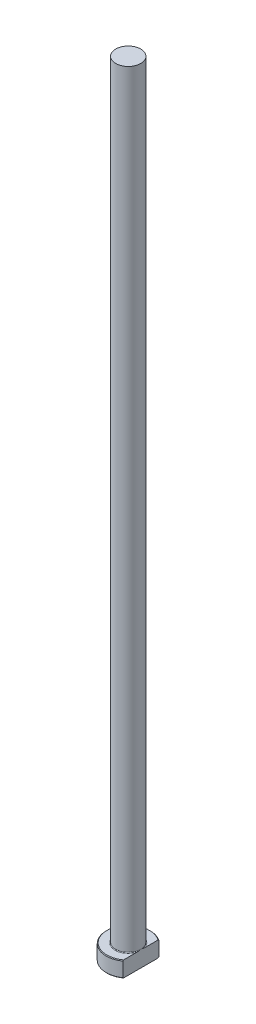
ISO-10303-21;
HEADER;
FILE_DESCRIPTION(('STEP AP214'),'2;1');
FILE_NAME('part.step','',(''),(''),'','','');
FILE_SCHEMA(('AUTOMOTIVE_DESIGN { 1 0 10303 214 1 1 1 1 }'));
ENDSEC;
DATA;
#1=APPLICATION_CONTEXT('core data for automotive mechanical design processes');
#2=APPLICATION_PROTOCOL_DEFINITION('international standard','automotive_design',2000,#1);
#3=PRODUCT_CONTEXT('',#1,'mechanical');
#4=PRODUCT('Part','Part','',(#3));
#5=PRODUCT_RELATED_PRODUCT_CATEGORY('part','',(#4));
#6=PRODUCT_DEFINITION_FORMATION('','',#4);
#7=PRODUCT_DEFINITION_CONTEXT('part definition',#1,'design');
#8=PRODUCT_DEFINITION('design','',#6,#7);
#9=PRODUCT_DEFINITION_SHAPE('','',#8);
#10=(LENGTH_UNIT() NAMED_UNIT(*) SI_UNIT(.MILLI.,.METRE.));
#11=(NAMED_UNIT(*) PLANE_ANGLE_UNIT() SI_UNIT($,.RADIAN.));
#12=(NAMED_UNIT(*) SI_UNIT($,.STERADIAN.) SOLID_ANGLE_UNIT());
#13=UNCERTAINTY_MEASURE_WITH_UNIT(LENGTH_MEASURE(1.E-05),#10,'distance_accuracy_value','');
#14=(GEOMETRIC_REPRESENTATION_CONTEXT(3) GLOBAL_UNCERTAINTY_ASSIGNED_CONTEXT((#13)) GLOBAL_UNIT_ASSIGNED_CONTEXT((#10,
#11,#12)) REPRESENTATION_CONTEXT('',''));
#15=CARTESIAN_POINT('',(0.,0.,0.));
#16=DIRECTION('',(0.,0.,1.));
#17=DIRECTION('',(1.,0.,0.));
#18=AXIS2_PLACEMENT_3D('',#15,#16,#17);
#19=CARTESIAN_POINT('',(0.,0.,0.));
#20=DIRECTION('',(0.,-1.,0.));
#21=DIRECTION('',(0.,0.,-1.));
#22=AXIS2_PLACEMENT_3D('',#19,#20,#21);
#23=PLANE('',#22);
#24=CARTESIAN_POINT('',(0.,0.,0.));
#25=DIRECTION('',(0.,-1.,0.));
#26=DIRECTION('',(0.,0.,-1.));
#27=AXIS2_PLACEMENT_3D('',#24,#25,#26);
#28=CIRCLE('',#27,6.79999999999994);
#29=CARTESIAN_POINT('',(3.99999999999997,0.,5.49909083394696));
#30=VERTEX_POINT('',#29);
#31=CARTESIAN_POINT('',(3.99999999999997,0.,-5.49909083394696));
#32=VERTEX_POINT('',#31);
#33=EDGE_CURVE('E98',#30,#32,#28,.T.);
#34=ORIENTED_EDGE('',*,*,#33,.T.);
#35=DIRECTION('',(0.,0.,1.));
#36=VECTOR('',#35,1.);
#37=CARTESIAN_POINT('',(3.99999999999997,0.,-5.74456264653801));
#38=LINE('',#37,#36);
#39=EDGE_CURVE('E83',#32,#30,#38,.T.);
#40=ORIENTED_EDGE('',*,*,#39,.T.);
#41=EDGE_LOOP('',(#34,#40));
#42=FACE_BOUND('',#41,.T.);
#43=ADVANCED_FACE('F32',(#42),#23,.T.);
#44=CARTESIAN_POINT('',(0.,259.958771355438,0.));
#45=DIRECTION('',(0.,1.,0.));
#46=DIRECTION('',(0.,0.,1.));
#47=AXIS2_PLACEMENT_3D('',#44,#45,#46);
#48=CYLINDRICAL_SURFACE('',#47,6.99999999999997);
#49=CARTESIAN_POINT('',(0.,4.80000000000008,0.));
#50=DIRECTION('',(0.,1.,0.));
#51=DIRECTION('',(0.,0.,1.));
#52=AXIS2_PLACEMENT_3D('',#49,#50,#51);
#53=CIRCLE('',#52,6.99999999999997);
#54=CARTESIAN_POINT('',(3.99999999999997,4.80000000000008,5.74456264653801));
#55=VERTEX_POINT('',#54);
#56=CARTESIAN_POINT('',(3.99999999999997,4.80000000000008,-5.74456264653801));
#57=VERTEX_POINT('',#56);
#58=EDGE_CURVE('E104',#55,#57,#53,.F.);
#59=ORIENTED_EDGE('',*,*,#58,.T.);
#60=DIRECTION('',(0.,-1.,0.));
#61=VECTOR('',#60,1.);
#62=CARTESIAN_POINT('',(3.99999999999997,250.,-5.74456264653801));
#63=LINE('',#62,#61);
#64=CARTESIAN_POINT('',(3.99999999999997,0.200000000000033,-5.74456264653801));
#65=VERTEX_POINT('',#64);
#66=EDGE_CURVE('E183',#57,#65,#63,.T.);
#67=ORIENTED_EDGE('',*,*,#66,.T.);
#68=CARTESIAN_POINT('',(0.,0.200000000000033,0.));
#69=DIRECTION('',(0.,-1.,0.));
#70=DIRECTION('',(0.,0.,-1.));
#71=AXIS2_PLACEMENT_3D('',#68,#69,#70);
#72=CIRCLE('',#71,6.99999999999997);
#73=CARTESIAN_POINT('',(3.99999999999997,0.200000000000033,5.74456264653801));
#74=VERTEX_POINT('',#73);
#75=EDGE_CURVE('E100',#65,#74,#72,.F.);
#76=ORIENTED_EDGE('',*,*,#75,.T.);
#77=DIRECTION('',(0.,-1.,0.));
#78=VECTOR('',#77,1.);
#79=CARTESIAN_POINT('',(3.99999999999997,250.,5.74456264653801));
#80=LINE('',#79,#78);
#81=EDGE_CURVE('E93',#55,#74,#80,.T.);
#82=ORIENTED_EDGE('',*,*,#81,.F.);
#83=EDGE_LOOP('',(#59,#67,#76,#82));
#84=FACE_BOUND('',#83,.T.);
#85=ADVANCED_FACE('F158',(#84),#48,.T.);
#86=CARTESIAN_POINT('',(-6.99999999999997,5.,0.));
#87=DIRECTION('',(0.,1.,0.));
#88=DIRECTION('',(0.,0.,1.));
#89=AXIS2_PLACEMENT_3D('',#86,#87,#88);
#90=PLANE('',#89);
#91=CARTESIAN_POINT('',(0.,5.,0.));
#92=DIRECTION('',(0.,1.,0.));
#93=DIRECTION('',(0.,0.,1.));
#94=AXIS2_PLACEMENT_3D('',#91,#92,#93);
#95=CIRCLE('',#94,6.80000000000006);
#96=CARTESIAN_POINT('',(3.99999999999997,5.,-5.4990908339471));
#97=VERTEX_POINT('',#96);
#98=CARTESIAN_POINT('',(3.99999999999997,5.,5.4990908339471));
#99=VERTEX_POINT('',#98);
#100=EDGE_CURVE('E178',#97,#99,#95,.T.);
#101=ORIENTED_EDGE('',*,*,#100,.T.);
#102=DIRECTION('',(0.,0.,-1.));
#103=VECTOR('',#102,1.);
#104=CARTESIAN_POINT('',(3.99999999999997,5.,0.));
#105=LINE('',#104,#103);
#106=CARTESIAN_POINT('',(3.99999999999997,4.99999999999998,1.28062484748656));
#107=VERTEX_POINT('',#106);
#108=EDGE_CURVE('E57',#99,#107,#105,.T.);
#109=ORIENTED_EDGE('',*,*,#108,.T.);
#110=CARTESIAN_POINT('',(0.,5.,0.));
#111=DIRECTION('',(0.,1.,0.));
#112=DIRECTION('',(0.,0.,1.));
#113=AXIS2_PLACEMENT_3D('',#110,#111,#112);
#114=CIRCLE('',#113,4.19999999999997);
#115=CARTESIAN_POINT('',(3.99999999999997,4.99999999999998,-1.28062484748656));
#116=VERTEX_POINT('',#115);
#117=EDGE_CURVE('E107',#107,#116,#114,.F.);
#118=ORIENTED_EDGE('',*,*,#117,.T.);
#119=EDGE_CURVE('E136',#116,#97,#105,.T.);
#120=ORIENTED_EDGE('',*,*,#119,.T.);
#121=EDGE_LOOP('',(#101,#109,#118,#120));
#122=FACE_BOUND('',#121,.T.);
#123=ADVANCED_FACE('F147',(#122),#90,.T.);
#124=CARTESIAN_POINT('',(0.,5.,0.));
#125=DIRECTION('',(0.,-1.,0.));
#126=DIRECTION('',(0.,0.,-1.));
#127=AXIS2_PLACEMENT_3D('',#124,#125,#126);
#128=CONICAL_SURFACE('',#127,6.80000000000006,0.785398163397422);
#129=ORIENTED_EDGE('',*,*,#58,.F.);
#130=CARTESIAN_POINT('',(3.99999999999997,-1.45712845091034,12.6392822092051));
#131=CARTESIAN_POINT('',(3.99999999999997,-1.24364466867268,12.4153556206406));
#132=CARTESIAN_POINT('',(3.99999999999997,-1.03042430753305,12.1911774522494));
#133=CARTESIAN_POINT('',(3.99999999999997,-0.604617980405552,11.7422167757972));
#134=CARTESIAN_POINT('',(3.99999999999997,-0.392032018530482,11.5174342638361));
#135=CARTESIAN_POINT('',(3.99999999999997,0.032462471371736,11.0670952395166));
#136=CARTESIAN_POINT('',(3.99999999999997,0.244370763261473,10.8415385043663));
#137=CARTESIAN_POINT('',(3.99999999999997,0.667290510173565,10.3895875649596));
#138=CARTESIAN_POINT('',(3.99999999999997,0.878301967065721,10.1631933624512));
#139=CARTESIAN_POINT('',(3.99999999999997,1.51385375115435,9.4781012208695));
#140=CARTESIAN_POINT('',(3.99999999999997,1.93676291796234,9.01788214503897));
#141=CARTESIAN_POINT('',(3.99999999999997,2.56612335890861,8.32309905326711));
#142=CARTESIAN_POINT('',(3.99999999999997,2.77505666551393,8.09078457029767));
#143=CARTESIAN_POINT('',(3.99999999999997,3.19080254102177,7.62426940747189));
#144=CARTESIAN_POINT('',(3.99999999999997,3.3976151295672,7.39006874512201));
#145=CARTESIAN_POINT('',(3.99999999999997,3.87870763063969,6.83891844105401));
#146=CARTESIAN_POINT('',(3.99999999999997,4.15190978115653,6.52102188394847));
#147=CARTESIAN_POINT('',(3.99999999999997,4.55642425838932,6.03960901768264));
#148=CARTESIAN_POINT('',(3.99999999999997,4.6904105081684,5.87833992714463));
#149=CARTESIAN_POINT('',(3.99999999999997,4.95616531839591,5.55398469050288));
#150=CARTESIAN_POINT('',(3.99999999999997,5.08793391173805,5.39089857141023));
#151=CARTESIAN_POINT('',(3.99999999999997,5.3484171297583,5.06288801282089));
#152=CARTESIAN_POINT('',(3.99999999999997,5.47713786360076,4.89796843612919));
#153=CARTESIAN_POINT('',(3.99999999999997,5.73107494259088,4.56545535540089));
#154=CARTESIAN_POINT('',(3.99999999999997,5.85629144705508,4.39786197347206));
#155=CARTESIAN_POINT('',(3.99999999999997,6.10211465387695,4.05948444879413));
#156=CARTESIAN_POINT('',(3.99999999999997,6.22272435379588,3.88870249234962));
#157=CARTESIAN_POINT('',(3.99999999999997,6.45796076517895,3.54308312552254));
#158=CARTESIAN_POINT('',(3.99999999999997,6.57258867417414,3.36824653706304));
#159=CARTESIAN_POINT('',(3.99999999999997,6.76866603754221,3.05381396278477));
#160=CARTESIAN_POINT('',(3.99999999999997,6.85173773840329,2.91523359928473));
#161=CARTESIAN_POINT('',(3.99999999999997,7.01174537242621,2.63451965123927));
#162=CARTESIAN_POINT('',(3.99999999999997,7.0886804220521,2.49238555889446));
#163=CARTESIAN_POINT('',(3.99999999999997,7.23459437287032,2.20416961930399));
#164=CARTESIAN_POINT('',(3.99999999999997,7.30357836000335,2.05809037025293));
#165=CARTESIAN_POINT('',(3.99999999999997,7.43135520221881,1.76151732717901));
#166=CARTESIAN_POINT('',(3.99999999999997,7.49015114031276,1.61102488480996));
#167=CARTESIAN_POINT('',(3.99999999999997,7.5824931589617,1.341420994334));
#168=CARTESIAN_POINT('',(3.99999999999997,7.61872660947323,1.22323501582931));
#169=CARTESIAN_POINT('',(3.99999999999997,7.68223354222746,0.984492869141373));
#170=CARTESIAN_POINT('',(3.99999999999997,7.7095104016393,0.863937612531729));
#171=CARTESIAN_POINT('',(3.99999999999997,7.75377914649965,0.62134258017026));
#172=CARTESIAN_POINT('',(3.99999999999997,7.77080509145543,0.499309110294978));
#173=CARTESIAN_POINT('',(3.99999999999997,7.79378778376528,0.254194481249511));
#174=CARTESIAN_POINT('',(3.99999999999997,7.79974523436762,0.13111338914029));
#175=CARTESIAN_POINT('',(3.99999999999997,7.8002395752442,-0.115517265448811));
#176=CARTESIAN_POINT('',(3.99999999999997,7.79473514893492,-0.239066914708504));
#177=CARTESIAN_POINT('',(3.99999999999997,7.77255119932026,-0.48514894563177));
#178=CARTESIAN_POINT('',(3.99999999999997,7.75587091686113,-0.607681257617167));
#179=CARTESIAN_POINT('',(3.99999999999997,7.71218353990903,-0.851269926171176));
#180=CARTESIAN_POINT('',(3.99999999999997,7.6851436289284,-0.972320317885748));
#181=CARTESIAN_POINT('',(3.99999999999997,7.62201202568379,-1.21200276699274));
#182=CARTESIAN_POINT('',(3.99999999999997,7.58591962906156,-1.33063463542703));
#183=CARTESIAN_POINT('',(3.99999999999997,7.45980070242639,-1.70122439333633));
#184=CARTESIAN_POINT('',(3.99999999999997,7.35572950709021,-1.94843335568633));
#185=CARTESIAN_POINT('',(3.99999999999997,7.18186715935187,-2.31048534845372));
#186=CARTESIAN_POINT('',(3.99999999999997,7.1208768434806,-2.429835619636));
#187=CARTESIAN_POINT('',(3.99999999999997,6.9940353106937,-2.66593629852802));
#188=CARTESIAN_POINT('',(3.99999999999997,6.92818466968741,-2.7826870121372));
#189=CARTESIAN_POINT('',(3.99999999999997,6.79157875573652,-3.01550895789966));
#190=CARTESIAN_POINT('',(3.99999999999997,6.72076681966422,-3.13154660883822));
#191=CARTESIAN_POINT('',(3.99999999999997,6.57583116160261,-3.36153379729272));
#192=CARTESIAN_POINT('',(3.99999999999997,6.50170736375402,-3.47548328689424));
#193=CARTESIAN_POINT('',(3.99999999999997,6.35080982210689,-3.70145107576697));
#194=CARTESIAN_POINT('',(3.99999999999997,6.27403866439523,-3.8134711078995));
#195=CARTESIAN_POINT('',(3.99999999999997,6.11824120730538,-4.03592316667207));
#196=CARTESIAN_POINT('',(3.99999999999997,6.03921496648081,-4.1463552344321));
#197=CARTESIAN_POINT('',(3.99999999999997,5.81506547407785,-4.45397159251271));
#198=CARTESIAN_POINT('',(3.99999999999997,5.66782256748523,-4.64961120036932));
#199=CARTESIAN_POINT('',(3.99999999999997,5.36880597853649,-5.03740600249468));
#200=CARTESIAN_POINT('',(3.99999999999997,5.21703183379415,-5.2295608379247));
#201=CARTESIAN_POINT('',(3.99999999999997,4.90999105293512,-5.61115465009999));
#202=CARTESIAN_POINT('',(3.99999999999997,4.75472331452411,-5.80059273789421));
#203=CARTESIAN_POINT('',(3.99999999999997,4.44150758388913,-6.17724364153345));
#204=CARTESIAN_POINT('',(3.99999999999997,4.28355951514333,-6.36445639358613));
#205=CARTESIAN_POINT('',(3.99999999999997,3.96525805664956,-6.73740614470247));
#206=CARTESIAN_POINT('',(3.99999999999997,3.80490084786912,-6.92313987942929));
#207=CARTESIAN_POINT('',(3.99999999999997,3.48247055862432,-7.29311320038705));
#208=CARTESIAN_POINT('',(3.99999999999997,3.32039746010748,-7.47735277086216));
#209=CARTESIAN_POINT('',(3.99999999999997,2.83216188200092,-8.02814826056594));
#210=CARTESIAN_POINT('',(3.99999999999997,2.50391696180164,-8.39285790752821));
#211=CARTESIAN_POINT('',(3.99999999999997,1.87512078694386,-9.08414492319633));
#212=CARTESIAN_POINT('',(3.99999999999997,1.57491666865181,-9.41103929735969));
#213=CARTESIAN_POINT('',(3.99999999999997,0.972153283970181,-10.0626830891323));
#214=CARTESIAN_POINT('',(3.99999999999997,0.669593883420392,-10.387432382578));
#215=CARTESIAN_POINT('',(3.99999999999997,0.0637759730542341,-11.0341169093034));
#216=CARTESIAN_POINT('',(3.99999999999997,-0.239476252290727,-11.3560580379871));
#217=CARTESIAN_POINT('',(3.99999999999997,-0.847356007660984,-11.9985921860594));
#218=CARTESIAN_POINT('',(3.99999999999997,-1.15198342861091,-12.3191853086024));
#219=CARTESIAN_POINT('',(3.99999999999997,-1.45712845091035,-12.6392822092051));
#220=B_SPLINE_CURVE_WITH_KNOTS('',3,(#130,#131,#132,#133,#134,#135,#136,#137,#138,#139,#140,
#141,#142,#143,#144,#145,#146,#147,#148,#149,#150,#151,#152,#153,#154,#155,#156,#157,#158,#159,
#160,#161,#162,#163,#164,#165,#166,#167,#168,#169,#170,#171,#172,#173,#174,#175,#176,#177,#178,
#179,#180,#181,#182,#183,#184,#185,#186,#187,#188,#189,#190,#191,#192,#193,#194,#195,#196,#197,
#198,#199,#200,#201,#202,#203,#204,#205,#206,#207,#208,#209,#210,#211,#212,#213,#214,#215,#216,
#217,#218,#219),.UNSPECIFIED.,.F.,.F.,(4,2,2,2,2,2,2,2,2,2,2,2,2,2,2,2,2,2,2,2,2,2,2,2,2,2,2,2,
2,2,2,2,2,2,2,2,2,2,2,2,2,2,2,2,4),(0.,0.928152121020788,1.85631024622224,2.7847626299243,
3.71321307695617,5.58823033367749,6.52556078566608,7.46288254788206,8.7202857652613,
9.34927045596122,9.97824580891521,10.6058302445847,11.2333861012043,11.8605264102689,
12.4875406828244,12.972136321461,13.4568016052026,13.9411551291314,14.4253618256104,
14.7959147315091,15.1663277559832,15.5355031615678,15.904655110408,16.2751400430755,
16.6456501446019,17.0173437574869,17.3890663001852,18.1913996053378,18.5934522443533,
18.9954573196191,19.4032100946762,19.8109722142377,20.2183467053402,20.6257106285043,
21.3601838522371,22.0947322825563,22.8295158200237,23.5643203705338,24.3004480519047,
25.036583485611,26.508549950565,27.8400191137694,29.1715646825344,30.4983881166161,
31.8251080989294),.UNSPECIFIED.);
#221=EDGE_CURVE('E135',#55,#99,#220,.T.);
#222=ORIENTED_EDGE('',*,*,#221,.T.);
#223=ORIENTED_EDGE('',*,*,#100,.F.);
#224=EDGE_CURVE('E127',#97,#57,#220,.T.);
#225=ORIENTED_EDGE('',*,*,#224,.T.);
#226=EDGE_LOOP('',(#129,#222,#223,#225));
#227=FACE_BOUND('',#226,.T.);
#228=ADVANCED_FACE('F143',(#227),#128,.T.);
#229=CARTESIAN_POINT('',(0.,0.200000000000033,0.));
#230=DIRECTION('',(0.,1.,0.));
#231=DIRECTION('',(0.,0.,1.));
#232=AXIS2_PLACEMENT_3D('',#229,#230,#231);
#233=CONICAL_SURFACE('',#232,6.99999999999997,0.785398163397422);
#234=ORIENTED_EDGE('',*,*,#75,.F.);
#235=CARTESIAN_POINT('',(3.99999999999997,6.45712845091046,-12.6392822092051));
#236=CARTESIAN_POINT('',(3.99999999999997,6.24364466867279,-12.4153556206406));
#237=CARTESIAN_POINT('',(3.99999999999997,6.03042430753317,-12.1911774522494));
#238=CARTESIAN_POINT('',(3.99999999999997,5.60461798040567,-11.7422167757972));
#239=CARTESIAN_POINT('',(3.99999999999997,5.3920320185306,-11.5174342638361));
#240=CARTESIAN_POINT('',(3.99999999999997,4.96753752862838,-11.0670952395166));
#241=CARTESIAN_POINT('',(3.99999999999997,4.75562923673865,-10.8415385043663));
#242=CARTESIAN_POINT('',(3.99999999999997,4.33270948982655,-10.3895875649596));
#243=CARTESIAN_POINT('',(3.99999999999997,4.1216980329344,-10.1631933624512));
#244=CARTESIAN_POINT('',(3.99999999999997,3.48614624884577,-9.47810122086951));
#245=CARTESIAN_POINT('',(3.99999999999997,3.06323708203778,-9.01788214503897));
#246=CARTESIAN_POINT('',(3.99999999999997,2.43387664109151,-8.32309905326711));
#247=CARTESIAN_POINT('',(3.99999999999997,2.22494333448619,-8.09078457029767));
#248=CARTESIAN_POINT('',(3.99999999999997,1.80919745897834,-7.62426940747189));
#249=CARTESIAN_POINT('',(3.99999999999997,1.60238487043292,-7.39006874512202));
#250=CARTESIAN_POINT('',(3.99999999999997,1.12129236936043,-6.83891844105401));
#251=CARTESIAN_POINT('',(3.99999999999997,0.848090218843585,-6.52102188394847));
#252=CARTESIAN_POINT('',(3.99999999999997,0.443575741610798,-6.03960901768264));
#253=CARTESIAN_POINT('',(3.99999999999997,0.309589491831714,-5.87833992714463));
#254=CARTESIAN_POINT('',(3.99999999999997,0.0438346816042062,-5.55398469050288));
#255=CARTESIAN_POINT('',(3.99999999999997,-0.0879339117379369,-5.39089857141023));
#256=CARTESIAN_POINT('',(3.99999999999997,-0.348417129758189,-5.06288801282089));
#257=CARTESIAN_POINT('',(3.99999999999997,-0.477137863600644,-4.89796843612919));
#258=CARTESIAN_POINT('',(3.99999999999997,-0.731074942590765,-4.56545535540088));
#259=CARTESIAN_POINT('',(3.99999999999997,-0.856291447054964,-4.39786197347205));
#260=CARTESIAN_POINT('',(3.99999999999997,-1.10211465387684,-4.05948444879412));
#261=CARTESIAN_POINT('',(3.99999999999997,-1.22272435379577,-3.88870249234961));
#262=CARTESIAN_POINT('',(3.99999999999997,-1.45796076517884,-3.54308312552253));
#263=CARTESIAN_POINT('',(3.99999999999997,-1.57258867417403,-3.36824653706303));
#264=CARTESIAN_POINT('',(3.99999999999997,-1.76866603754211,-3.05381396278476));
#265=CARTESIAN_POINT('',(3.99999999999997,-1.85173773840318,-2.91523359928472));
#266=CARTESIAN_POINT('',(3.99999999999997,-2.0117453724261,-2.63451965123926));
#267=CARTESIAN_POINT('',(3.99999999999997,-2.08868042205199,-2.49238555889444));
#268=CARTESIAN_POINT('',(3.99999999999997,-2.23459437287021,-2.20416961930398));
#269=CARTESIAN_POINT('',(3.99999999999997,-2.30357836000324,-2.05809037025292));
#270=CARTESIAN_POINT('',(3.99999999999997,-2.43135520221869,-1.761517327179));
#271=CARTESIAN_POINT('',(3.99999999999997,-2.49015114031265,-1.61102488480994));
#272=CARTESIAN_POINT('',(3.99999999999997,-2.58249315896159,-1.34142099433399));
#273=CARTESIAN_POINT('',(3.99999999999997,-2.61872660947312,-1.2232350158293));
#274=CARTESIAN_POINT('',(3.99999999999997,-2.68223354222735,-0.984492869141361));
#275=CARTESIAN_POINT('',(3.99999999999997,-2.70951040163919,-0.863937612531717));
#276=CARTESIAN_POINT('',(3.99999999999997,-2.75377914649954,-0.621342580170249));
#277=CARTESIAN_POINT('',(3.99999999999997,-2.77080509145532,-0.499309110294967));
#278=CARTESIAN_POINT('',(3.99999999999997,-2.79378778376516,-0.2541944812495));
#279=CARTESIAN_POINT('',(3.99999999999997,-2.7997452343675,-0.131113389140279));
#280=CARTESIAN_POINT('',(3.99999999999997,-2.80023957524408,0.115517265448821));
#281=CARTESIAN_POINT('',(3.99999999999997,-2.79473514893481,0.239066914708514));
#282=CARTESIAN_POINT('',(3.99999999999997,-2.77255119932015,0.48514894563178));
#283=CARTESIAN_POINT('',(3.99999999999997,-2.75587091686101,0.607681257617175));
#284=CARTESIAN_POINT('',(3.99999999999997,-2.71218353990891,0.851269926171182));
#285=CARTESIAN_POINT('',(3.99999999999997,-2.68514362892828,0.972320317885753));
#286=CARTESIAN_POINT('',(3.99999999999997,-2.62201202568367,1.21200276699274));
#287=CARTESIAN_POINT('',(3.99999999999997,-2.58591962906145,1.33063463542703));
#288=CARTESIAN_POINT('',(3.99999999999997,-2.45980070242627,1.70122439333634));
#289=CARTESIAN_POINT('',(3.99999999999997,-2.35572950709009,1.94843335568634));
#290=CARTESIAN_POINT('',(3.99999999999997,-2.18186715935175,2.31048534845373));
#291=CARTESIAN_POINT('',(3.99999999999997,-2.12087684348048,2.42983561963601));
#292=CARTESIAN_POINT('',(3.99999999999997,-1.99403531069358,2.66593629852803));
#293=CARTESIAN_POINT('',(3.99999999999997,-1.92818466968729,2.78268701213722));
#294=CARTESIAN_POINT('',(3.99999999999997,-1.7915787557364,3.01550895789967));
#295=CARTESIAN_POINT('',(3.99999999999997,-1.72076681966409,3.13154660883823));
#296=CARTESIAN_POINT('',(3.99999999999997,-1.57583116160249,3.36153379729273));
#297=CARTESIAN_POINT('',(3.99999999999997,-1.50170736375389,3.47548328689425));
#298=CARTESIAN_POINT('',(3.99999999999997,-1.35080982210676,3.70145107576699));
#299=CARTESIAN_POINT('',(3.99999999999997,-1.2740386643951,3.81347110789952));
#300=CARTESIAN_POINT('',(3.99999999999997,-1.11824120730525,4.0359231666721));
#301=CARTESIAN_POINT('',(3.99999999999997,-1.03921496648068,4.14635523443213));
#302=CARTESIAN_POINT('',(3.99999999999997,-0.815065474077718,4.45397159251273));
#303=CARTESIAN_POINT('',(3.99999999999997,-0.667822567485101,4.64961120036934));
#304=CARTESIAN_POINT('',(3.99999999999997,-0.368805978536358,5.0374060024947));
#305=CARTESIAN_POINT('',(3.99999999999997,-0.21703183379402,5.22956083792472));
#306=CARTESIAN_POINT('',(3.99999999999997,0.0900089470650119,5.61115465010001));
#307=CARTESIAN_POINT('',(3.99999999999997,0.245276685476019,5.80059273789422));
#308=CARTESIAN_POINT('',(3.99999999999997,0.558492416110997,6.17724364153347));
#309=CARTESIAN_POINT('',(3.99999999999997,0.716440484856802,6.36445639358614));
#310=CARTESIAN_POINT('',(3.99999999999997,1.03474194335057,6.73740614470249));
#311=CARTESIAN_POINT('',(3.99999999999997,1.195099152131,6.9231398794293));
#312=CARTESIAN_POINT('',(3.99999999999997,1.5175294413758,7.29311320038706));
#313=CARTESIAN_POINT('',(3.99999999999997,1.67960253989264,7.47735277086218));
#314=CARTESIAN_POINT('',(3.99999999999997,2.16783811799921,8.02814826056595));
#315=CARTESIAN_POINT('',(3.99999999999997,2.49608303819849,8.39285790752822));
#316=CARTESIAN_POINT('',(3.99999999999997,3.12487921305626,9.08414492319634));
#317=CARTESIAN_POINT('',(3.99999999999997,3.42508333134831,9.4110392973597));
#318=CARTESIAN_POINT('',(3.99999999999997,4.02784671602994,10.0626830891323));
#319=CARTESIAN_POINT('',(3.99999999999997,4.33040611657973,10.387432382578));
#320=CARTESIAN_POINT('',(3.99999999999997,4.93622402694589,11.0341169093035));
#321=CARTESIAN_POINT('',(3.99999999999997,5.23947625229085,11.3560580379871));
#322=CARTESIAN_POINT('',(3.99999999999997,5.8473560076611,11.9985921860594));
#323=CARTESIAN_POINT('',(3.99999999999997,6.15198342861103,12.3191853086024));
#324=CARTESIAN_POINT('',(3.99999999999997,6.45712845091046,12.6392822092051));
#325=B_SPLINE_CURVE_WITH_KNOTS('',3,(#235,#236,#237,#238,#239,#240,#241,#242,#243,#244,#245,
#246,#247,#248,#249,#250,#251,#252,#253,#254,#255,#256,#257,#258,#259,#260,#261,#262,#263,#264,
#265,#266,#267,#268,#269,#270,#271,#272,#273,#274,#275,#276,#277,#278,#279,#280,#281,#282,#283,
#284,#285,#286,#287,#288,#289,#290,#291,#292,#293,#294,#295,#296,#297,#298,#299,#300,#301,#302,
#303,#304,#305,#306,#307,#308,#309,#310,#311,#312,#313,#314,#315,#316,#317,#318,#319,#320,#321,
#322,#323,#324),.UNSPECIFIED.,.F.,.F.,(4,2,2,2,2,2,2,2,2,2,2,2,2,2,2,2,2,2,2,2,2,2,2,2,2,2,2,2,
2,2,2,2,2,2,2,2,2,2,2,2,2,2,2,2,4),(0.,0.928152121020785,1.85631024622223,2.78476262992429,
3.71321307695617,5.58823033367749,6.52556078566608,7.46288254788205,8.7202857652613,
9.34927045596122,9.97824580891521,10.6058302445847,11.2333861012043,11.8605264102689,
12.4875406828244,12.972136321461,13.4568016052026,13.9411551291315,14.4253618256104,
14.7959147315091,15.1663277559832,15.5355031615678,15.904655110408,16.2751400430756,
16.6456501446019,17.0173437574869,17.3890663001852,18.1913996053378,18.5934522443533,
18.9954573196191,19.4032100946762,19.8109722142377,20.2183467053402,20.6257106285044,
21.3601838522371,22.0947322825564,22.8295158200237,23.5643203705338,24.3004480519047,
25.0365834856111,26.508549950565,27.8400191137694,29.1715646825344,30.4983881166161,
31.8251080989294),.UNSPECIFIED.);
#326=EDGE_CURVE('E86',#65,#32,#325,.T.);
#327=ORIENTED_EDGE('',*,*,#326,.T.);
#328=ORIENTED_EDGE('',*,*,#33,.F.);
#329=EDGE_CURVE('E89',#30,#74,#325,.T.);
#330=ORIENTED_EDGE('',*,*,#329,.T.);
#331=EDGE_LOOP('',(#234,#327,#328,#330));
#332=FACE_BOUND('',#331,.T.);
#333=ADVANCED_FACE('F97',(#332),#233,.T.);
#334=CARTESIAN_POINT('',(0.,5.19999999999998,0.));
#335=DIRECTION('',(0.,1.,0.));
#336=DIRECTION('',(0.,0.,1.));
#337=AXIS2_PLACEMENT_3D('',#334,#335,#336);
#338=TOROIDAL_SURFACE('',#337,4.19999999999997,0.2);
#339=CARTESIAN_POINT('',(3.99999999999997,5.19999999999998,0.));
#340=CARTESIAN_POINT('',(3.99999999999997,5.20000051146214,6.55036346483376E-12));
#341=CARTESIAN_POINT('',(3.99999999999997,5.20000102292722,-2.33849506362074E-07));
#342=CARTESIAN_POINT('',(3.99999999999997,5.20000197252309,-8.59106878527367E-07));
#343=CARTESIAN_POINT('',(3.99999999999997,5.20000239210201,-1.26721104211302E-06));
#344=CARTESIAN_POINT('',(3.99999999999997,5.2000032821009,-2.25074272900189E-06));
#345=CARTESIAN_POINT('',(3.99999999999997,5.20000373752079,-2.84212509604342E-06));
#346=CARTESIAN_POINT('',(3.99999999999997,5.20000453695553,-4.0532804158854E-06));
#347=CARTESIAN_POINT('',(3.99999999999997,5.20000488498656,-4.67066373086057E-06));
#348=CARTESIAN_POINT('',(3.99999999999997,5.20000621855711,-7.11716595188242E-06));
#349=CARTESIAN_POINT('',(3.99999999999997,5.20000713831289,-8.9855846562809E-06));
#350=CARTESIAN_POINT('',(3.99999999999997,5.20000861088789,-1.26418241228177E-05));
#351=CARTESIAN_POINT('',(3.99999999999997,5.20000919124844,-1.44189478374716E-05));
#352=CARTESIAN_POINT('',(3.99999999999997,5.20001169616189,-2.20915834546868E-05));
#353=CARTESIAN_POINT('',(3.99999999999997,5.20001361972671,-2.79894745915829E-05));
#354=CARTESIAN_POINT('',(3.99999999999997,5.20001638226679,-3.90228530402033E-05));
#355=CARTESIAN_POINT('',(3.99999999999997,5.20001734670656,-4.41264575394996E-05));
#356=CARTESIAN_POINT('',(3.99999999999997,5.20002447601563,-8.24800894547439E-05));
#357=CARTESIAN_POINT('',(3.99999999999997,5.20003000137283,-0.000115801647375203));
#358=CARTESIAN_POINT('',(3.99999999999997,5.20005417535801,-0.000248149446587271));
#359=CARTESIAN_POINT('',(3.99999999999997,5.20007711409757,-0.00034639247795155));
#360=CARTESIAN_POINT('',(3.99999999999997,5.20016695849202,-0.000737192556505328));
#361=CARTESIAN_POINT('',(3.99999999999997,5.2002311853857,-0.00103015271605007));
#362=CARTESIAN_POINT('',(3.99999999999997,5.20048943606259,-0.00220000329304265));
#363=CARTESIAN_POINT('',(3.99999999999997,5.20068689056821,-0.00307635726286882));
#364=CARTESIAN_POINT('',(3.99999999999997,5.2015124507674,-0.00674945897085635));
#365=CARTESIAN_POINT('',(3.99999999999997,5.20213623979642,-0.00954688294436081));
#366=CARTESIAN_POINT('',(3.99999999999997,5.21069858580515,-0.0479346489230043));
#367=CARTESIAN_POINT('',(3.99999999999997,5.21866411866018,-0.083521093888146));
#368=CARTESIAN_POINT('',(3.99999999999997,5.23536251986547,-0.158673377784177));
#369=CARTESIAN_POINT('',(3.99999999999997,5.24408230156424,-0.198242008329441));
#370=CARTESIAN_POINT('',(3.99999999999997,5.25875222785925,-0.265746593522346));
#371=CARTESIAN_POINT('',(3.99999999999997,5.264760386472,-0.293669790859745));
#372=CARTESIAN_POINT('',(3.99999999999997,5.27645424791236,-0.348796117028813));
#373=CARTESIAN_POINT('',(3.99999999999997,5.2821442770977,-0.375998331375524));
#374=CARTESIAN_POINT('',(3.99999999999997,5.30043795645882,-0.465036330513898));
#375=CARTESIAN_POINT('',(3.99999999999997,5.31263876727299,-0.526956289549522));
#376=CARTESIAN_POINT('',(3.99999999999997,5.33561275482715,-0.65168218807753));
#377=CARTESIAN_POINT('',(3.99999999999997,5.34637105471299,-0.714490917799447));
#378=CARTESIAN_POINT('',(3.99999999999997,5.36658245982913,-0.846543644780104));
#379=CARTESIAN_POINT('',(3.99999999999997,5.37580902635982,-0.915823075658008));
#380=CARTESIAN_POINT('',(3.99999999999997,5.39039845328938,-1.05460878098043));
#381=CARTESIAN_POINT('',(3.99999999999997,5.39577328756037,-1.12411367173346));
#382=CARTESIAN_POINT('',(3.99999999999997,5.39959291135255,-1.22750409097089));
#383=CARTESIAN_POINT('',(3.99999999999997,5.40018074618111,-1.26130913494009));
#384=CARTESIAN_POINT('',(3.99999999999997,5.39972074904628,-1.32890426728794));
#385=CARTESIAN_POINT('',(3.99999999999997,5.39867346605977,-1.36269435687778));
#386=CARTESIAN_POINT('',(3.99999999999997,5.39455571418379,-1.42954089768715));
#387=CARTESIAN_POINT('',(3.99999999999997,5.39152235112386,-1.46259952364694));
#388=CARTESIAN_POINT('',(3.99999999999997,5.38286512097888,-1.52835908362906));
#389=CARTESIAN_POINT('',(3.99999999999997,5.37724516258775,-1.56106048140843));
#390=CARTESIAN_POINT('',(3.99999999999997,5.36402263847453,-1.61846409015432));
#391=CARTESIAN_POINT('',(3.99999999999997,5.35713757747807,-1.64332989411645));
#392=CARTESIAN_POINT('',(3.99999999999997,5.34027199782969,-1.69212725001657));
#393=CARTESIAN_POINT('',(3.99999999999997,5.33028876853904,-1.7160579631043));
#394=CARTESIAN_POINT('',(3.99999999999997,5.31168601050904,-1.75008824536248));
#395=CARTESIAN_POINT('',(3.99999999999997,5.30485398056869,-1.76115159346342));
#396=CARTESIAN_POINT('',(3.99999999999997,5.28960114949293,-1.78210611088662));
#397=CARTESIAN_POINT('',(3.99999999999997,5.28118962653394,-1.79200360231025));
#398=CARTESIAN_POINT('',(3.99999999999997,5.26737388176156,-1.80493475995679));
#399=CARTESIAN_POINT('',(3.99999999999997,5.26276322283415,-1.80881084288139));
#400=CARTESIAN_POINT('',(3.99999999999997,5.25306023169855,-1.81592390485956));
#401=CARTESIAN_POINT('',(3.99999999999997,5.24796771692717,-1.81916064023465));
#402=CARTESIAN_POINT('',(3.99999999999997,5.23724406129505,-1.82480514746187));
#403=CARTESIAN_POINT('',(3.99999999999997,5.23160666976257,-1.82720134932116));
#404=CARTESIAN_POINT('',(3.99999999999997,5.219971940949,-1.83083611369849));
#405=CARTESIAN_POINT('',(3.99999999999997,5.21397550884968,-1.83207746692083));
#406=CARTESIAN_POINT('',(3.99999999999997,5.20263132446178,-1.83315692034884));
#407=CARTESIAN_POINT('',(3.99999999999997,5.19729868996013,-1.8331541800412));
#408=CARTESIAN_POINT('',(3.99999999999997,5.18672944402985,-1.83214057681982));
#409=CARTESIAN_POINT('',(3.99999999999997,5.18149289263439,-1.83112910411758));
#410=CARTESIAN_POINT('',(3.99999999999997,5.17078487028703,-1.82806907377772));
#411=CARTESIAN_POINT('',(3.99999999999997,5.16533999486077,-1.82592931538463));
#412=CARTESIAN_POINT('',(3.99999999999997,5.1548729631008,-1.82079411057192));
#413=CARTESIAN_POINT('',(3.99999999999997,5.14985146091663,-1.81779737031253));
#414=CARTESIAN_POINT('',(3.99999999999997,5.13773920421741,-1.80942140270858));
#415=CARTESIAN_POINT('',(3.99999999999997,5.13094534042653,-1.80361715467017));
#416=CARTESIAN_POINT('',(3.99999999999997,5.11830005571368,-1.79106454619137));
#417=CARTESIAN_POINT('',(3.99999999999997,5.11245134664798,-1.78431356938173));
#418=CARTESIAN_POINT('',(3.99999999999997,5.09656788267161,-1.76377799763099));
#419=CARTESIAN_POINT('',(3.99999999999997,5.08757958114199,-1.74919341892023));
#420=CARTESIAN_POINT('',(3.99999999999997,5.07165230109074,-1.71899459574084));
#421=CARTESIAN_POINT('',(3.99999999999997,5.064716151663,-1.70337896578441));
#422=CARTESIAN_POINT('',(3.99999999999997,5.04964646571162,-1.66459665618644));
#423=CARTESIAN_POINT('',(3.99999999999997,5.04232016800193,-1.64111968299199));
#424=CARTESIAN_POINT('',(3.99999999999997,5.02986383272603,-1.59357415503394));
#425=CARTESIAN_POINT('',(3.99999999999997,5.02473853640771,-1.56950444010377));
#426=CARTESIAN_POINT('',(3.99999999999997,5.0161032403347,-1.52067485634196));
#427=CARTESIAN_POINT('',(3.99999999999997,5.01262117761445,-1.49591014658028));
#428=CARTESIAN_POINT('',(3.99999999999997,5.00704256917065,-1.44626562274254));
#429=CARTESIAN_POINT('',(3.99999999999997,5.00494421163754,-1.42138600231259));
#430=CARTESIAN_POINT('',(3.99999999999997,5.00075077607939,-1.35341124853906));
#431=CARTESIAN_POINT('',(3.99999999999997,4.99977133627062,-1.31024782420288));
#432=CARTESIAN_POINT('',(3.99999999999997,5.00031303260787,-1.22392963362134));
#433=CARTESIAN_POINT('',(3.99999999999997,5.00183577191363,-1.18077489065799));
#434=CARTESIAN_POINT('',(3.99999999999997,5.00931890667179,-1.05109835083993));
#435=CARTESIAN_POINT('',(3.99999999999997,5.01820648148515,-0.964749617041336));
#436=CARTESIAN_POINT('',(3.99999999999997,5.03989342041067,-0.800200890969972));
#437=CARTESIAN_POINT('',(3.99999999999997,5.05228816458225,-0.721941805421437));
#438=CARTESIAN_POINT('',(3.99999999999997,5.07962880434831,-0.566748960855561));
#439=CARTESIAN_POINT('',(3.99999999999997,5.09454562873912,-0.4898100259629));
#440=CARTESIAN_POINT('',(3.99999999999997,5.115946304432,-0.385191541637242));
#441=CARTESIAN_POINT('',(3.99999999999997,5.12174621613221,-0.357366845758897));
#442=CARTESIAN_POINT('',(3.99999999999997,5.13367824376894,-0.300962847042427));
#443=CARTESIAN_POINT('',(3.99999999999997,5.13981511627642,-0.272384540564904));
#444=CARTESIAN_POINT('',(3.99999999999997,5.15483459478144,-0.203169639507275));
#445=CARTESIAN_POINT('',(3.99999999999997,5.16378036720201,-0.1625469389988));
#446=CARTESIAN_POINT('',(3.99999999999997,5.18091599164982,-0.0854009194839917));
#447=CARTESIAN_POINT('',(3.99999999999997,5.18909179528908,-0.0488746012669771));
#448=CARTESIAN_POINT('',(3.99999999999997,5.19786384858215,-0.00954647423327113));
#449=CARTESIAN_POINT('',(3.99999999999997,5.19848773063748,-0.0067486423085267));
#450=CARTESIAN_POINT('',(3.99999999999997,5.19931331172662,-0.00307545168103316));
#451=CARTESIAN_POINT('',(3.99999999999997,5.19951069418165,-0.00219941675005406));
#452=CARTESIAN_POINT('',(3.99999999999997,5.19976885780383,-0.00102996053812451));
#453=CARTESIAN_POINT('',(3.99999999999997,5.199833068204,-0.000737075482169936));
#454=CARTESIAN_POINT('',(3.99999999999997,5.19992289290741,-0.00034636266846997));
#455=CARTESIAN_POINT('',(3.99999999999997,5.19994582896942,-0.000248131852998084));
#456=CARTESIAN_POINT('',(3.99999999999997,5.19997000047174,-0.000115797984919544));
#457=CARTESIAN_POINT('',(3.99999999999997,5.19997552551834,-8.24780552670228E-05));
#458=CARTESIAN_POINT('',(3.99999999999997,5.19998265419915,-4.4126093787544E-05));
#459=CARTESIAN_POINT('',(3.99999999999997,5.19998361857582,-3.90225725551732E-05));
#460=CARTESIAN_POINT('',(3.99999999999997,5.19998638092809,-2.79893703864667E-05));
#461=CARTESIAN_POINT('',(3.99999999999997,5.19998830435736,-2.20915678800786E-05));
#462=CARTESIAN_POINT('',(3.99999999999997,5.19999080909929,-1.44190255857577E-05));
#463=CARTESIAN_POINT('',(3.99999999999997,5.19999138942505,-1.26419078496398E-05));
#464=CARTESIAN_POINT('',(3.99999999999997,5.19999286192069,-8.98567517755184E-06));
#465=CARTESIAN_POINT('',(3.99999999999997,5.1999937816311,-7.1172564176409E-06));
#466=CARTESIAN_POINT('',(3.99999999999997,5.19999511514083,-4.67074826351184E-06));
#467=CARTESIAN_POINT('',(3.99999999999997,5.19999546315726,-4.05336147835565E-06));
#468=CARTESIAN_POINT('',(3.99999999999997,5.19999626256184,-2.84219658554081E-06));
#469=CARTESIAN_POINT('',(3.99999999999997,5.19999671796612,-2.25080798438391E-06));
#470=CARTESIAN_POINT('',(3.99999999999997,5.19999760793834,-1.26726200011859E-06));
#471=CARTESIAN_POINT('',(3.99999999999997,5.19999802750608,-8.59150369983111E-07));
#472=CARTESIAN_POINT('',(3.99999999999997,5.19999897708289,-2.33873741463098E-07));
#473=CARTESIAN_POINT('',(3.99999999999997,5.19999948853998,-6.55033592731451E-12));
#474=CARTESIAN_POINT('',(3.99999999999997,5.19999999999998,0.));
#475=B_SPLINE_CURVE_WITH_KNOTS('',3,(#339,#340,#341,#342,#343,#344,#345,#346,#347,#348,#349,
#350,#351,#352,#353,#354,#355,#356,#357,#358,#359,#360,#361,#362,#363,#364,#365,#366,#367,#368,
#369,#370,#371,#372,#373,#374,#375,#376,#377,#378,#379,#380,#381,#382,#383,#384,#385,#386,#387,
#388,#389,#390,#391,#392,#393,#394,#395,#396,#397,#398,#399,#400,#401,#402,#403,#404,#405,#406,
#407,#408,#409,#410,#411,#412,#413,#414,#415,#416,#417,#418,#419,#420,#421,#422,#423,#424,#425,
#426,#427,#428,#429,#430,#431,#432,#433,#434,#435,#436,#437,#438,#439,#440,#441,#442,#443,#444,
#445,#446,#447,#448,#449,#450,#451,#452,#453,#454,#455,#456,#457,#458,#459,#460,#461,#462,#463,
#464,#465,#466,#467,#468,#469,#470,#471,#472,#473,#474),.UNSPECIFIED.,.T.,.F.,(4,2,2,2,2,2,2,2,
2,2,2,2,2,2,2,2,2,2,2,2,2,2,2,2,2,2,2,2,2,2,2,2,2,2,2,2,2,2,2,2,2,2,2,2,2,2,2,2,2,2,2,2,2,2,2,2,
2,2,2,2,2,2,2,2,2,2,2,4),(0.,1.56012585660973E-06,3.32588854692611E-06,5.54921869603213E-06,
7.67484576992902E-06,1.39023138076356E-05,1.95054937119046E-05,3.80905024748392E-05,
5.36549282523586E-05,0.000155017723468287,0.000457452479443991,0.00135744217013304,
0.00405212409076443,0.0126508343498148,0.122049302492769,0.243603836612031,0.329290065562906,
0.412662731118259,0.601981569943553,0.79312323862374,1.00273287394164,1.21168803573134,
1.31308928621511,1.4144564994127,1.51398193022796,1.6133574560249,1.6906629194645,
1.76803621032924,1.8069612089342,1.84566433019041,1.8636943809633,1.88173129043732,
1.9000075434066,1.91823951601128,1.93413978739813,1.95004967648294,1.9675051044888,
1.98498702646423,2.01164257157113,2.03837328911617,2.08948035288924,2.14065754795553,
2.21426121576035,2.28802264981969,2.36299656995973,2.43787212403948,2.56728534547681,
2.69678151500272,2.95692568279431,3.19457926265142,3.42966002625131,3.51492857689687,
3.60261719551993,3.72740578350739,3.8396934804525,3.84829344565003,3.85098714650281,
3.85188690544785,3.85218930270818,3.8522906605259,3.85230622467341,3.85232480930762,
3.85233041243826,3.85233663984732,3.85233876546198,3.85234098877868,3.85234275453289,
3.85234431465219),.UNSPECIFIED.);
#476=CARTESIAN_POINT('',(3.99999999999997,5.19999999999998,0.));
#477=VERTEX_POINT('',#476);
#478=EDGE_CURVE('E11',#116,#477,#475,.T.);
#479=ORIENTED_EDGE('',*,*,#478,.F.);
#480=ORIENTED_EDGE('',*,*,#117,.F.);
#481=CARTESIAN_POINT('',(3.99999999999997,5.19999999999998,0.));
#482=CARTESIAN_POINT('',(3.99999999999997,5.19999948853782,-6.55004438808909E-12));
#483=CARTESIAN_POINT('',(3.99999999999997,5.19999897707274,2.33849506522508E-07));
#484=CARTESIAN_POINT('',(3.99999999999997,5.19999802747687,8.59106878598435E-07));
#485=CARTESIAN_POINT('',(3.99999999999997,5.19999760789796,1.26721104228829E-06));
#486=CARTESIAN_POINT('',(3.99999999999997,5.19999671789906,2.25074272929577E-06));
#487=CARTESIAN_POINT('',(3.99999999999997,5.19999626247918,2.84212509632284E-06));
#488=CARTESIAN_POINT('',(3.99999999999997,5.19999546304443,4.05328041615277E-06));
#489=CARTESIAN_POINT('',(3.99999999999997,5.1999951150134,4.67066373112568E-06));
#490=CARTESIAN_POINT('',(3.99999999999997,5.19999378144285,7.11716595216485E-06));
#491=CARTESIAN_POINT('',(3.99999999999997,5.19999286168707,8.98558465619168E-06));
#492=CARTESIAN_POINT('',(3.99999999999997,5.19999138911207,1.26418241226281E-05));
#493=CARTESIAN_POINT('',(3.99999999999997,5.19999080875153,1.44189478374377E-05));
#494=CARTESIAN_POINT('',(3.99999999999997,5.19998830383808,2.20915834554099E-05));
#495=CARTESIAN_POINT('',(3.99999999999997,5.19998638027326,2.79894745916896E-05));
#496=CARTESIAN_POINT('',(3.99999999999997,5.19998361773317,3.90228530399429E-05));
#497=CARTESIAN_POINT('',(3.99999999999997,5.19998265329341,4.41264575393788E-05));
#498=CARTESIAN_POINT('',(3.99999999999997,5.19997552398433,8.24800894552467E-05));
#499=CARTESIAN_POINT('',(3.99999999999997,5.19996999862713,0.000115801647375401));
#500=CARTESIAN_POINT('',(3.99999999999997,5.19994582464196,0.00024814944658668));
#501=CARTESIAN_POINT('',(3.99999999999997,5.1999228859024,0.000346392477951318));
#502=CARTESIAN_POINT('',(3.99999999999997,5.19983304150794,0.00073719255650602));
#503=CARTESIAN_POINT('',(3.99999999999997,5.19976881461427,0.00103015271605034));
#504=CARTESIAN_POINT('',(3.99999999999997,5.19951056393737,0.00220000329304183));
#505=CARTESIAN_POINT('',(3.99999999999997,5.19931310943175,0.00307635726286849));
#506=CARTESIAN_POINT('',(3.99999999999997,5.19848754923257,0.0067494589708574));
#507=CARTESIAN_POINT('',(3.99999999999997,5.19786376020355,0.00954688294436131));
#508=CARTESIAN_POINT('',(3.99999999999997,5.1893014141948,0.047934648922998));
#509=CARTESIAN_POINT('',(3.99999999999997,5.18133588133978,0.0835210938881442));
#510=CARTESIAN_POINT('',(3.99999999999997,5.1646374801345,0.158673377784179));
#511=CARTESIAN_POINT('',(3.99999999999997,5.15591769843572,0.198242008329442));
#512=CARTESIAN_POINT('',(3.99999999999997,5.14124777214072,0.265746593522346));
#513=CARTESIAN_POINT('',(3.99999999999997,5.13523961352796,0.293669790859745));
#514=CARTESIAN_POINT('',(3.99999999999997,5.12354575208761,0.348796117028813));
#515=CARTESIAN_POINT('',(3.99999999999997,5.11785572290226,0.375998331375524));
#516=CARTESIAN_POINT('',(3.99999999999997,5.09956204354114,0.465036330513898));
#517=CARTESIAN_POINT('',(3.99999999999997,5.08736123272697,0.526956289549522));
#518=CARTESIAN_POINT('',(3.99999999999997,5.06438724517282,0.65168218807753));
#519=CARTESIAN_POINT('',(3.99999999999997,5.05362894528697,0.714490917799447));
#520=CARTESIAN_POINT('',(3.99999999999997,5.03341754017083,0.846543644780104));
#521=CARTESIAN_POINT('',(3.99999999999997,5.02419097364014,0.915823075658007));
#522=CARTESIAN_POINT('',(3.99999999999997,5.00960154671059,1.05460878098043));
#523=CARTESIAN_POINT('',(3.99999999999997,5.0042267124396,1.12411367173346));
#524=CARTESIAN_POINT('',(3.99999999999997,5.00040708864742,1.22750409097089));
#525=CARTESIAN_POINT('',(3.99999999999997,4.99981925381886,1.26130913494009));
#526=CARTESIAN_POINT('',(3.99999999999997,5.00027925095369,1.32890426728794));
#527=CARTESIAN_POINT('',(3.99999999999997,5.0013265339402,1.36269435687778));
#528=CARTESIAN_POINT('',(3.99999999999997,5.00544428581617,1.42954089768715));
#529=CARTESIAN_POINT('',(3.99999999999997,5.00847764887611,1.46259952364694));
#530=CARTESIAN_POINT('',(3.99999999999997,5.01713487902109,1.52835908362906));
#531=CARTESIAN_POINT('',(3.99999999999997,5.02275483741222,1.56106048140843));
#532=CARTESIAN_POINT('',(3.99999999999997,5.03597736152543,1.61846409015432));
#533=CARTESIAN_POINT('',(3.99999999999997,5.04286242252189,1.64332989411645));
#534=CARTESIAN_POINT('',(3.99999999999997,5.05972800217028,1.69212725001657));
#535=CARTESIAN_POINT('',(3.99999999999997,5.06971123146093,1.7160579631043));
#536=CARTESIAN_POINT('',(3.99999999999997,5.08831398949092,1.75008824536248));
#537=CARTESIAN_POINT('',(3.99999999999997,5.09514601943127,1.76115159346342));
#538=CARTESIAN_POINT('',(3.99999999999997,5.11039885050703,1.78210611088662));
#539=CARTESIAN_POINT('',(3.99999999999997,5.11881037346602,1.79200360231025));
#540=CARTESIAN_POINT('',(3.99999999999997,5.13262611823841,1.80493475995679));
#541=CARTESIAN_POINT('',(3.99999999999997,5.13723677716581,1.80881084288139));
#542=CARTESIAN_POINT('',(3.99999999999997,5.14693976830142,1.81592390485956));
#543=CARTESIAN_POINT('',(3.99999999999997,5.1520322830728,1.81916064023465));
#544=CARTESIAN_POINT('',(3.99999999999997,5.16275593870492,1.82480514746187));
#545=CARTESIAN_POINT('',(3.99999999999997,5.16839333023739,1.82720134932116));
#546=CARTESIAN_POINT('',(3.99999999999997,5.18002805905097,1.83083611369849));
#547=CARTESIAN_POINT('',(3.99999999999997,5.18602449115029,1.83207746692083));
#548=CARTESIAN_POINT('',(3.99999999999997,5.19736867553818,1.83315692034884));
#549=CARTESIAN_POINT('',(3.99999999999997,5.20270131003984,1.8331541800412));
#550=CARTESIAN_POINT('',(3.99999999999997,5.21327055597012,1.83214057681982));
#551=CARTESIAN_POINT('',(3.99999999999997,5.21850710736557,1.83112910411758));
#552=CARTESIAN_POINT('',(3.99999999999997,5.22921512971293,1.82806907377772));
#553=CARTESIAN_POINT('',(3.99999999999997,5.2346600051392,1.82592931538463));
#554=CARTESIAN_POINT('',(3.99999999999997,5.24512703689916,1.82079411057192));
#555=CARTESIAN_POINT('',(3.99999999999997,5.25014853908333,1.81779737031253));
#556=CARTESIAN_POINT('',(3.99999999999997,5.26226079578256,1.80942140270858));
#557=CARTESIAN_POINT('',(3.99999999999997,5.26905465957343,1.80361715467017));
#558=CARTESIAN_POINT('',(3.99999999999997,5.28169994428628,1.79106454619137));
#559=CARTESIAN_POINT('',(3.99999999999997,5.28754865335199,1.78431356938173));
#560=CARTESIAN_POINT('',(3.99999999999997,5.30343211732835,1.76377799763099));
#561=CARTESIAN_POINT('',(3.99999999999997,5.31242041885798,1.74919341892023));
#562=CARTESIAN_POINT('',(3.99999999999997,5.32834769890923,1.71899459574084));
#563=CARTESIAN_POINT('',(3.99999999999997,5.33528384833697,1.70337896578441));
#564=CARTESIAN_POINT('',(3.99999999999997,5.35035353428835,1.66459665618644));
#565=CARTESIAN_POINT('',(3.99999999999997,5.35767983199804,1.64111968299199));
#566=CARTESIAN_POINT('',(3.99999999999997,5.37013616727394,1.59357415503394));
#567=CARTESIAN_POINT('',(3.99999999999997,5.37526146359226,1.56950444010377));
#568=CARTESIAN_POINT('',(3.99999999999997,5.38389675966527,1.52067485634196));
#569=CARTESIAN_POINT('',(3.99999999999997,5.38737882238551,1.49591014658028));
#570=CARTESIAN_POINT('',(3.99999999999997,5.39295743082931,1.44626562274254));
#571=CARTESIAN_POINT('',(3.99999999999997,5.39505578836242,1.42138600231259));
#572=CARTESIAN_POINT('',(3.99999999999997,5.39924922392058,1.35341124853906));
#573=CARTESIAN_POINT('',(3.99999999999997,5.40022866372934,1.31024782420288));
#574=CARTESIAN_POINT('',(3.99999999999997,5.3996869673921,1.22392963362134));
#575=CARTESIAN_POINT('',(3.99999999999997,5.39816422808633,1.18077489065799));
#576=CARTESIAN_POINT('',(3.99999999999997,5.39068109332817,1.05109835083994));
#577=CARTESIAN_POINT('',(3.99999999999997,5.38179351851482,0.964749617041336));
#578=CARTESIAN_POINT('',(3.99999999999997,5.36010657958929,0.800200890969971));
#579=CARTESIAN_POINT('',(3.99999999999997,5.34771183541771,0.721941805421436));
#580=CARTESIAN_POINT('',(3.99999999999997,5.32037119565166,0.56674896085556));
#581=CARTESIAN_POINT('',(3.99999999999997,5.30545437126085,0.4898100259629));
#582=CARTESIAN_POINT('',(3.99999999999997,5.28405369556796,0.385191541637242));
#583=CARTESIAN_POINT('',(3.99999999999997,5.27825378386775,0.357366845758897));
#584=CARTESIAN_POINT('',(3.99999999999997,5.26632175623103,0.300962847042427));
#585=CARTESIAN_POINT('',(3.99999999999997,5.26018488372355,0.272384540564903));
#586=CARTESIAN_POINT('',(3.99999999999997,5.24516540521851,0.203169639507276));
#587=CARTESIAN_POINT('',(3.99999999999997,5.23621963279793,0.162546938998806));
#588=CARTESIAN_POINT('',(3.99999999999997,5.21908400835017,0.0854009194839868));
#589=CARTESIAN_POINT('',(3.99999999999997,5.21090820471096,0.0488746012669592));
#590=CARTESIAN_POINT('',(3.99999999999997,5.20213615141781,0.00954647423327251));
#591=CARTESIAN_POINT('',(3.99999999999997,5.20151226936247,0.00674864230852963));
#592=CARTESIAN_POINT('',(3.99999999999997,5.20068668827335,0.00307545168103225));
#593=CARTESIAN_POINT('',(3.99999999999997,5.20048930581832,0.00219941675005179));
#594=CARTESIAN_POINT('',(3.99999999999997,5.20023114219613,0.00102996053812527));
#595=CARTESIAN_POINT('',(3.99999999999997,5.20016693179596,0.00073707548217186));
#596=CARTESIAN_POINT('',(3.99999999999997,5.20007710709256,0.000346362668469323));
#597=CARTESIAN_POINT('',(3.99999999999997,5.20005417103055,0.000248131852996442));
#598=CARTESIAN_POINT('',(3.99999999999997,5.20002999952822,0.000115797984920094));
#599=CARTESIAN_POINT('',(3.99999999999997,5.20002447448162,8.24780552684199E-05));
#600=CARTESIAN_POINT('',(3.99999999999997,5.20001734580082,4.41260937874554E-05));
#601=CARTESIAN_POINT('',(3.99999999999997,5.20001638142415,3.9022572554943E-05));
#602=CARTESIAN_POINT('',(3.99999999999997,5.20001361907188,2.79893703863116E-05));
#603=CARTESIAN_POINT('',(3.99999999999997,5.2000116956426,2.20915678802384E-05));
#604=CARTESIAN_POINT('',(3.99999999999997,5.20000919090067,1.4419025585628E-05));
#605=CARTESIAN_POINT('',(3.99999999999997,5.20000861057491,1.26419078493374E-05));
#606=CARTESIAN_POINT('',(3.99999999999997,5.20000713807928,8.98567517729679E-06));
#607=CARTESIAN_POINT('',(3.99999999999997,5.20000621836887,7.11725641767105E-06));
#608=CARTESIAN_POINT('',(3.99999999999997,5.20000488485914,4.67074826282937E-06));
#609=CARTESIAN_POINT('',(3.99999999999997,5.20000453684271,4.05336147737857E-06));
#610=CARTESIAN_POINT('',(3.99999999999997,5.20000373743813,2.84219658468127E-06));
#611=CARTESIAN_POINT('',(3.99999999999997,5.20000328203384,2.25080798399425E-06));
#612=CARTESIAN_POINT('',(3.99999999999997,5.20000239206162,1.2672619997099E-06));
#613=CARTESIAN_POINT('',(3.99999999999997,5.20000197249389,8.59150369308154E-07));
#614=CARTESIAN_POINT('',(3.99999999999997,5.20000102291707,2.33873740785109E-07));
#615=CARTESIAN_POINT('',(3.99999999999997,5.20000051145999,6.55001685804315E-12));
#616=CARTESIAN_POINT('',(3.99999999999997,5.19999999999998,0.));
#617=B_SPLINE_CURVE_WITH_KNOTS('',3,(#481,#482,#483,#484,#485,#486,#487,#488,#489,#490,#491,
#492,#493,#494,#495,#496,#497,#498,#499,#500,#501,#502,#503,#504,#505,#506,#507,#508,#509,#510,
#511,#512,#513,#514,#515,#516,#517,#518,#519,#520,#521,#522,#523,#524,#525,#526,#527,#528,#529,
#530,#531,#532,#533,#534,#535,#536,#537,#538,#539,#540,#541,#542,#543,#544,#545,#546,#547,#548,
#549,#550,#551,#552,#553,#554,#555,#556,#557,#558,#559,#560,#561,#562,#563,#564,#565,#566,#567,
#568,#569,#570,#571,#572,#573,#574,#575,#576,#577,#578,#579,#580,#581,#582,#583,#584,#585,#586,
#587,#588,#589,#590,#591,#592,#593,#594,#595,#596,#597,#598,#599,#600,#601,#602,#603,#604,#605,
#606,#607,#608,#609,#610,#611,#612,#613,#614,#615,#616),.UNSPECIFIED.,.T.,.F.,(4,2,2,2,2,2,2,2,
2,2,2,2,2,2,2,2,2,2,2,2,2,2,2,2,2,2,2,2,2,2,2,2,2,2,2,2,2,2,2,2,2,2,2,2,2,2,2,2,2,2,2,2,2,2,2,2,
2,2,2,2,2,2,2,2,2,2,2,4),(0.,1.56012585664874E-06,3.32588854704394E-06,5.54921869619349E-06,
7.67484577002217E-06,1.39023138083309E-05,1.95054937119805E-05,3.80905024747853E-05,
5.36549282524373E-05,0.000155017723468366,0.00045745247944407,0.00135744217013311,
0.00405212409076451,0.0126508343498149,0.122049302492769,0.243603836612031,0.329290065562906,
0.412662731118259,0.601981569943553,0.79312323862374,1.00273287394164,1.21168803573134,
1.31308928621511,1.4144564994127,1.51398193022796,1.6133574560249,1.69066291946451,
1.76803621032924,1.8069612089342,1.84566433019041,1.8636943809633,1.88173129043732,
1.9000075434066,1.91823951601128,1.93413978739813,1.95004967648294,1.9675051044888,
1.98498702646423,2.01164257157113,2.03837328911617,2.08948035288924,2.14065754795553,
2.21426121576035,2.28802264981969,2.36299656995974,2.43787212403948,2.56728534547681,
2.69678151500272,2.95692568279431,3.19457926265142,3.42966002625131,3.51492857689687,
3.60261719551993,3.72740578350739,3.8396934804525,3.84829344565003,3.85098714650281,
3.85188690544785,3.85218930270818,3.8522906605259,3.85230622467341,3.85232480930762,
3.85233041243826,3.85233663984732,3.85233876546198,3.85234098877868,3.85234275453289,
3.85234431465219),.UNSPECIFIED.);
#618=EDGE_CURVE('E46',#477,#107,#617,.T.);
#619=ORIENTED_EDGE('',*,*,#618,.F.);
#620=CARTESIAN_POINT('',(0.,5.19999999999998,0.));
#621=DIRECTION('',(0.,1.,0.));
#622=DIRECTION('',(0.,0.,1.));
#623=AXIS2_PLACEMENT_3D('',#620,#621,#622);
#624=CIRCLE('',#623,3.99999999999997);
#625=EDGE_CURVE('E103',#477,#477,#624,.T.);
#626=ORIENTED_EDGE('',*,*,#625,.F.);
#627=EDGE_LOOP('',(#479,#480,#619,#626));
#628=FACE_BOUND('',#627,.T.);
#629=ADVANCED_FACE('F34',(#628),#338,.F.);
#630=CARTESIAN_POINT('',(0.,259.958771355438,0.));
#631=DIRECTION('',(0.,1.,0.));
#632=DIRECTION('',(0.,0.,1.));
#633=AXIS2_PLACEMENT_3D('',#630,#631,#632);
#634=CYLINDRICAL_SURFACE('',#633,3.99999999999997);
#635=ORIENTED_EDGE('',*,*,#625,.T.);
#636=EDGE_LOOP('',(#635));
#637=FACE_BOUND('',#636,.T.);
#638=CARTESIAN_POINT('',(0.,250.,0.));
#639=DIRECTION('',(0.,1.,0.));
#640=DIRECTION('',(0.,0.,1.));
#641=AXIS2_PLACEMENT_3D('',#638,#639,#640);
#642=CIRCLE('',#641,3.99999999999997);
#643=CARTESIAN_POINT('',(0.,250.,3.99999999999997));
#644=VERTEX_POINT('',#643);
#645=EDGE_CURVE('E101',#644,#644,#642,.T.);
#646=ORIENTED_EDGE('',*,*,#645,.F.);
#647=EDGE_LOOP('',(#646));
#648=FACE_BOUND('',#647,.T.);
#649=ADVANCED_FACE('F155',(#637,#648),#634,.T.);
#650=CARTESIAN_POINT('',(-3.99999999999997,250.,0.));
#651=DIRECTION('',(0.,1.,0.));
#652=DIRECTION('',(0.,0.,1.));
#653=AXIS2_PLACEMENT_3D('',#650,#651,#652);
#654=PLANE('',#653);
#655=ORIENTED_EDGE('',*,*,#645,.T.);
#656=EDGE_LOOP('',(#655));
#657=FACE_BOUND('',#656,.T.);
#658=ADVANCED_FACE('F121',(#657),#654,.T.);
#659=CARTESIAN_POINT('',(3.99999999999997,250.,-5.74456264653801));
#660=DIRECTION('',(1.,0.,0.));
#661=DIRECTION('',(0.,0.,-1.));
#662=AXIS2_PLACEMENT_3D('',#659,#660,#661);
#663=PLANE('',#662);
#664=ORIENTED_EDGE('',*,*,#66,.F.);
#665=ORIENTED_EDGE('',*,*,#224,.F.);
#666=ORIENTED_EDGE('',*,*,#119,.F.);
#667=ORIENTED_EDGE('',*,*,#478,.T.);
#668=ORIENTED_EDGE('',*,*,#618,.T.);
#669=ORIENTED_EDGE('',*,*,#108,.F.);
#670=ORIENTED_EDGE('',*,*,#221,.F.);
#671=ORIENTED_EDGE('',*,*,#81,.T.);
#672=ORIENTED_EDGE('',*,*,#329,.F.);
#673=ORIENTED_EDGE('',*,*,#39,.F.);
#674=ORIENTED_EDGE('',*,*,#326,.F.);
#675=EDGE_LOOP('',(#664,#665,#666,#667,#668,#669,#670,#671,#672,#673,#674));
#676=FACE_BOUND('',#675,.T.);
#677=ADVANCED_FACE('F85',(#676),#663,.T.);
#678=CLOSED_SHELL('',(#43,#85,#123,#228,#333,#629,#649,#658,#677));
#679=MANIFOLD_SOLID_BREP('B2',#678);
#680=ADVANCED_BREP_SHAPE_REPRESENTATION('',(#18,#679),#14);
#681=SHAPE_DEFINITION_REPRESENTATION(#9,#680);
ENDSEC;
END-ISO-10303-21;
